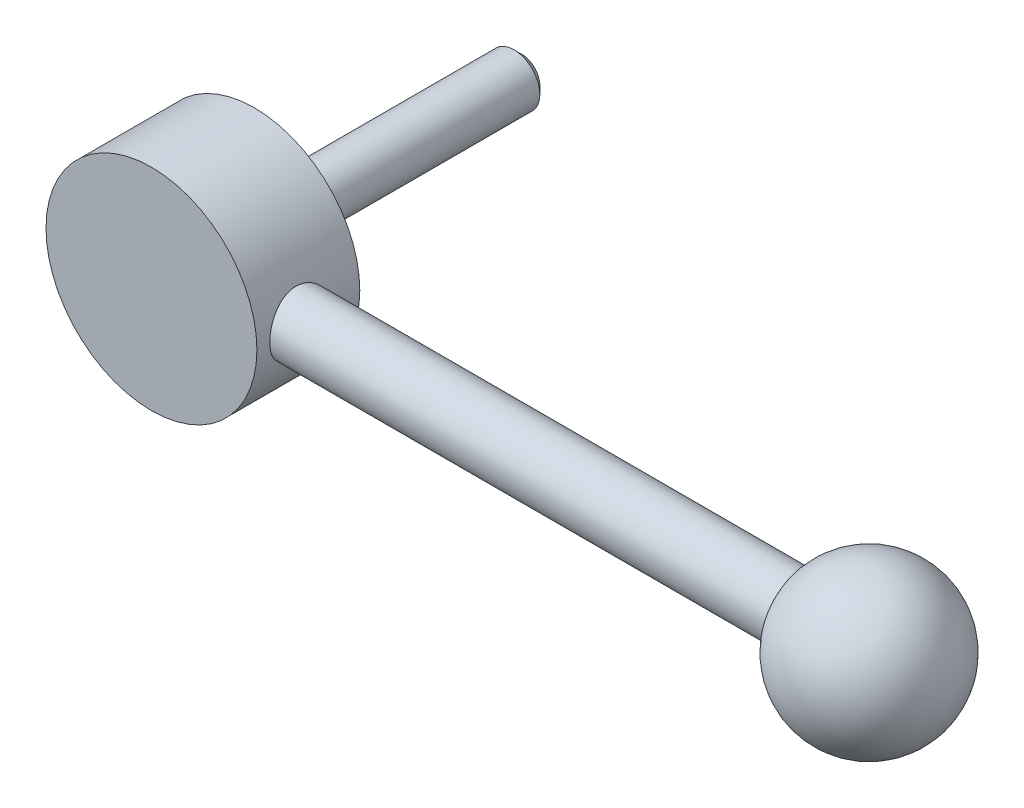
ISO-10303-21;
HEADER;
FILE_DESCRIPTION(('STEP AP214'),'2;1');
FILE_NAME('part.step','',(''),(''),'','','');
FILE_SCHEMA(('AUTOMOTIVE_DESIGN { 1 0 10303 214 1 1 1 1 }'));
ENDSEC;
DATA;
#1=APPLICATION_CONTEXT('core data for automotive mechanical design processes');
#2=APPLICATION_PROTOCOL_DEFINITION('international standard','automotive_design',2000,#1);
#3=PRODUCT_CONTEXT('',#1,'mechanical');
#4=PRODUCT('Part','Part','',(#3));
#5=PRODUCT_RELATED_PRODUCT_CATEGORY('part','',(#4));
#6=PRODUCT_DEFINITION_FORMATION('','',#4);
#7=PRODUCT_DEFINITION_CONTEXT('part definition',#1,'design');
#8=PRODUCT_DEFINITION('design','',#6,#7);
#9=PRODUCT_DEFINITION_SHAPE('','',#8);
#10=(LENGTH_UNIT() NAMED_UNIT(*) SI_UNIT(.MILLI.,.METRE.));
#11=(NAMED_UNIT(*) PLANE_ANGLE_UNIT() SI_UNIT($,.RADIAN.));
#12=(NAMED_UNIT(*) SI_UNIT($,.STERADIAN.) SOLID_ANGLE_UNIT());
#13=UNCERTAINTY_MEASURE_WITH_UNIT(LENGTH_MEASURE(1.E-05),#10,'distance_accuracy_value','');
#14=(GEOMETRIC_REPRESENTATION_CONTEXT(3) GLOBAL_UNCERTAINTY_ASSIGNED_CONTEXT((#13)) GLOBAL_UNIT_ASSIGNED_CONTEXT((#10,
#11,#12)) REPRESENTATION_CONTEXT('',''));
#15=CARTESIAN_POINT('',(0.,0.,0.));
#16=DIRECTION('',(0.,0.,1.));
#17=DIRECTION('',(1.,0.,0.));
#18=AXIS2_PLACEMENT_3D('',#15,#16,#17);
#19=CARTESIAN_POINT('',(0.,0.,40.));
#20=DIRECTION('',(0.,0.,1.));
#21=DIRECTION('',(1.,0.,0.));
#22=AXIS2_PLACEMENT_3D('',#19,#20,#21);
#23=CYLINDRICAL_SURFACE('',#22,9.5);
#24=CARTESIAN_POINT('',(0.,0.,2.));
#25=DIRECTION('',(0.,0.,1.));
#26=DIRECTION('',(1.,0.,0.));
#27=AXIS2_PLACEMENT_3D('',#24,#25,#26);
#28=CIRCLE('',#27,9.5);
#29=CARTESIAN_POINT('',(9.5,0.,2.));
#30=VERTEX_POINT('',#29);
#31=EDGE_CURVE('E37',#30,#30,#28,.T.);
#32=ORIENTED_EDGE('',*,*,#31,.F.);
#33=EDGE_LOOP('',(#32));
#34=FACE_BOUND('',#33,.T.);
#35=CARTESIAN_POINT('',(0.,0.,0.));
#36=DIRECTION('',(0.,0.,1.));
#37=DIRECTION('',(1.,0.,0.));
#38=AXIS2_PLACEMENT_3D('',#35,#36,#37);
#39=CIRCLE('',#38,9.5);
#40=CARTESIAN_POINT('',(9.5,0.,0.));
#41=VERTEX_POINT('',#40);
#42=EDGE_CURVE('E23',#41,#41,#39,.T.);
#43=ORIENTED_EDGE('',*,*,#42,.T.);
#44=EDGE_LOOP('',(#43));
#45=FACE_BOUND('',#44,.T.);
#46=ADVANCED_FACE('F12',(#34,#45),#23,.T.);
#47=CARTESIAN_POINT('',(5.,0.,0.));
#48=DIRECTION('',(0.,0.,1.));
#49=DIRECTION('',(1.,0.,0.));
#50=AXIS2_PLACEMENT_3D('',#47,#48,#49);
#51=PLANE('',#50);
#52=ORIENTED_EDGE('',*,*,#42,.F.);
#53=EDGE_LOOP('',(#52));
#54=FACE_BOUND('',#53,.T.);
#55=CARTESIAN_POINT('',(0.,0.,0.));
#56=DIRECTION('',(0.,0.,1.));
#57=DIRECTION('',(1.,0.,0.));
#58=AXIS2_PLACEMENT_3D('',#55,#56,#57);
#59=CIRCLE('',#58,5.);
#60=CARTESIAN_POINT('',(5.,0.,0.));
#61=VERTEX_POINT('',#60);
#62=EDGE_CURVE('E27',#61,#61,#59,.T.);
#63=ORIENTED_EDGE('',*,*,#62,.T.);
#64=EDGE_LOOP('',(#63));
#65=FACE_BOUND('',#64,.T.);
#66=ADVANCED_FACE('F63',(#54,#65),#51,.F.);
#67=CARTESIAN_POINT('',(0.,0.,40.));
#68=DIRECTION('',(0.,0.,1.));
#69=DIRECTION('',(1.,0.,0.));
#70=AXIS2_PLACEMENT_3D('',#67,#68,#69);
#71=CYLINDRICAL_SURFACE('',#70,5.);
#72=CARTESIAN_POINT('',(0.,0.,-48.5));
#73=DIRECTION('',(0.,0.,-1.));
#74=DIRECTION('',(-1.,0.,0.));
#75=AXIS2_PLACEMENT_3D('',#72,#73,#74);
#76=CIRCLE('',#75,5.);
#77=CARTESIAN_POINT('',(-5.,0.,-48.5));
#78=VERTEX_POINT('',#77);
#79=EDGE_CURVE('E19',#78,#78,#76,.F.);
#80=ORIENTED_EDGE('',*,*,#79,.T.);
#81=EDGE_LOOP('',(#80));
#82=FACE_BOUND('',#81,.T.);
#83=ORIENTED_EDGE('',*,*,#62,.F.);
#84=EDGE_LOOP('',(#83));
#85=FACE_BOUND('',#84,.T.);
#86=ADVANCED_FACE('F69',(#82,#85),#71,.T.);
#87=CARTESIAN_POINT('',(5.,0.,-50.));
#88=DIRECTION('',(0.,0.,-1.));
#89=DIRECTION('',(-1.,0.,0.));
#90=AXIS2_PLACEMENT_3D('',#87,#88,#89);
#91=PLANE('',#90);
#92=CARTESIAN_POINT('',(0.,0.,-50.));
#93=DIRECTION('',(0.,0.,-1.));
#94=DIRECTION('',(-1.,0.,0.));
#95=AXIS2_PLACEMENT_3D('',#92,#93,#94);
#96=CIRCLE('',#95,3.5);
#97=CARTESIAN_POINT('',(-3.5,0.,-50.));
#98=VERTEX_POINT('',#97);
#99=EDGE_CURVE('E8',#98,#98,#96,.T.);
#100=ORIENTED_EDGE('',*,*,#99,.T.);
#101=EDGE_LOOP('',(#100));
#102=FACE_BOUND('',#101,.T.);
#103=ADVANCED_FACE('F77',(#102),#91,.T.);
#104=CARTESIAN_POINT('',(20.5,0.,22.));
#105=DIRECTION('',(0.,0.,-1.));
#106=DIRECTION('',(-1.,0.,0.));
#107=AXIS2_PLACEMENT_3D('',#104,#105,#106);
#108=PLANE('',#107);
#109=CARTESIAN_POINT('',(0.,0.,22.));
#110=DIRECTION('',(0.,0.,1.));
#111=DIRECTION('',(1.,0.,0.));
#112=AXIS2_PLACEMENT_3D('',#109,#110,#111);
#113=CIRCLE('',#112,20.5);
#114=CARTESIAN_POINT('',(20.5,0.,22.));
#115=VERTEX_POINT('',#114);
#116=EDGE_CURVE('E86',#115,#115,#113,.T.);
#117=ORIENTED_EDGE('',*,*,#116,.T.);
#118=EDGE_LOOP('',(#117));
#119=FACE_BOUND('',#118,.T.);
#120=ADVANCED_FACE('F58',(#119),#108,.F.);
#121=CARTESIAN_POINT('',(0.,0.,40.));
#122=DIRECTION('',(0.,0.,1.));
#123=DIRECTION('',(1.,0.,0.));
#124=AXIS2_PLACEMENT_3D('',#121,#122,#123);
#125=CYLINDRICAL_SURFACE('',#124,20.5);
#126=CARTESIAN_POINT('',(20.5,0.,7.5));
#127=CARTESIAN_POINT('',(20.4999997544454,-0.164768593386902,7.50000038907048));
#128=CARTESIAN_POINT('',(20.4980087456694,-0.329544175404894,7.50679278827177));
#129=CARTESIAN_POINT('',(20.4900990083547,-0.65788822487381,7.5339021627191));
#130=CARTESIAN_POINT('',(20.4841800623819,-0.821456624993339,7.55421988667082));
#131=CARTESIAN_POINT('',(20.4685766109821,-1.1462122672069,7.60820100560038));
#132=CARTESIAN_POINT('',(20.4588916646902,-1.30739922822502,7.64186596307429));
#133=CARTESIAN_POINT('',(20.4360164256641,-1.62628314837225,7.72226244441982));
#134=CARTESIAN_POINT('',(20.4228249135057,-1.7839788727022,7.76899851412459));
#135=CARTESIAN_POINT('',(20.3933182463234,-2.09448185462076,7.87505403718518));
#136=CARTESIAN_POINT('',(20.3770082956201,-2.24729676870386,7.93435254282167));
#137=CARTESIAN_POINT('',(20.3416823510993,-2.54730770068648,8.06511256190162));
#138=CARTESIAN_POINT('',(20.3226662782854,-2.69450355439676,8.13657443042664));
#139=CARTESIAN_POINT('',(20.2824208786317,-2.98237032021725,8.2911456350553));
#140=CARTESIAN_POINT('',(20.2611910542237,-3.123039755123,8.37425759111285));
#141=CARTESIAN_POINT('',(20.2170775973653,-3.39691169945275,8.55150630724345));
#142=CARTESIAN_POINT('',(20.1941944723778,-3.53011647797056,8.6456396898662));
#143=CARTESIAN_POINT('',(20.146767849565,-3.79154794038,8.84682399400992));
#144=CARTESIAN_POINT('',(20.1221971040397,-3.91956600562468,8.95413966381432));
#145=CARTESIAN_POINT('',(20.0725990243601,-4.1661228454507,9.17897611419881));
#146=CARTESIAN_POINT('',(20.0475718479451,-4.2846648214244,9.29649342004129));
#147=CARTESIAN_POINT('',(19.9977175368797,-4.5116297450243,9.54108035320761));
#148=CARTESIAN_POINT('',(19.9728905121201,-4.62004743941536,9.66815487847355));
#149=CARTESIAN_POINT('',(19.9241410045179,-4.82595045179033,9.93095842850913));
#150=CARTESIAN_POINT('',(19.9002181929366,-4.92343976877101,10.0666842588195));
#151=CARTESIAN_POINT('',(19.8534354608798,-5.10885934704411,10.3490171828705));
#152=CARTESIAN_POINT('',(19.8306098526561,-5.19653638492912,10.4957964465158));
#153=CARTESIAN_POINT('',(19.7872868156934,-5.35913808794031,10.7965125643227));
#154=CARTESIAN_POINT('',(19.766788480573,-5.43406772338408,10.9504465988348));
#155=CARTESIAN_POINT('',(19.7287391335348,-5.57062666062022,11.2645036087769));
#156=CARTESIAN_POINT('',(19.7111887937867,-5.63225293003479,11.4246279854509));
#157=CARTESIAN_POINT('',(19.6796082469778,-5.74162541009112,11.7498143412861));
#158=CARTESIAN_POINT('',(19.6655765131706,-5.78937764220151,11.9148741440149));
#159=CARTESIAN_POINT('',(19.6418018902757,-5.86952471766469,12.2443484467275));
#160=CARTESIAN_POINT('',(19.6319555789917,-5.90229162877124,12.4086649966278));
#161=CARTESIAN_POINT('',(19.6163432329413,-5.95397424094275,12.7395899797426));
#162=CARTESIAN_POINT('',(19.6105755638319,-5.97289549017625,12.9061974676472));
#163=CARTESIAN_POINT('',(19.603301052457,-5.99672775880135,13.2405034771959));
#164=CARTESIAN_POINT('',(19.6017941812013,-6.00163887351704,13.4082019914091));
#165=CARTESIAN_POINT('',(19.6030905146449,-5.99740342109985,13.7434027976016));
#166=CARTESIAN_POINT('',(19.6058936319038,-5.98825713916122,13.9109050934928));
#167=CARTESIAN_POINT('',(19.6155486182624,-5.95655212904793,14.238688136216));
#168=CARTESIAN_POINT('',(19.6222578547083,-5.9344657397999,14.3990190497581));
#169=CARTESIAN_POINT('',(19.6394095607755,-5.87745500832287,14.7172343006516));
#170=CARTESIAN_POINT('',(19.649853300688,-5.84252629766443,14.8751177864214));
#171=CARTESIAN_POINT('',(19.6741615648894,-5.7601395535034,15.187257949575));
#172=CARTESIAN_POINT('',(19.688025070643,-5.71268525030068,15.3415156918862));
#173=CARTESIAN_POINT('',(19.7187796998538,-5.60560692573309,15.6454959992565));
#174=CARTESIAN_POINT('',(19.7356719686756,-5.5459782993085,15.7952168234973));
#175=CARTESIAN_POINT('',(19.7722410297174,-5.41416819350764,16.0910079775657));
#176=CARTESIAN_POINT('',(19.7919506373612,-5.34183608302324,16.2370072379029));
#177=CARTESIAN_POINT('',(19.8334359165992,-5.18568691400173,16.5224423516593));
#178=CARTESIAN_POINT('',(19.8552123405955,-5.10186566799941,16.6618757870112));
#179=CARTESIAN_POINT('',(19.9227548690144,-4.8340177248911,17.0689782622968));
#180=CARTESIAN_POINT('',(19.9707648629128,-4.63350124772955,17.3256854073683));
#181=CARTESIAN_POINT('',(20.0696162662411,-4.18511260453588,17.8126329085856));
#182=CARTESIAN_POINT('',(20.1204944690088,-3.93567819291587,18.0414205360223));
#183=CARTESIAN_POINT('',(20.2176813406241,-3.40132203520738,18.4542852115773));
#184=CARTESIAN_POINT('',(20.2639897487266,-3.11639826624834,18.63835970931));
#185=CARTESIAN_POINT('',(20.3472018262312,-2.51664006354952,18.9573414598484));
#186=CARTESIAN_POINT('',(20.3840462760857,-2.2016334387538,19.0919412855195));
#187=CARTESIAN_POINT('',(20.4437541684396,-1.55212614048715,19.3058343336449));
#188=CARTESIAN_POINT('',(20.4666213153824,-1.21763065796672,19.3851422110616));
#189=CARTESIAN_POINT('',(20.4952175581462,-0.550953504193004,19.4838192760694));
#190=CARTESIAN_POINT('',(20.5015074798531,-0.219085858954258,19.5051506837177));
#191=CARTESIAN_POINT('',(20.4978783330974,0.44350281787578,19.4927506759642));
#192=CARTESIAN_POINT('',(20.4879613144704,0.774223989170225,19.4590262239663));
#193=CARTESIAN_POINT('',(20.4533992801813,1.41781519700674,19.3390673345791));
#194=CARTESIAN_POINT('',(20.4290727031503,1.73091547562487,19.253967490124));
#195=CARTESIAN_POINT('',(20.3684901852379,2.33834273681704,19.0350155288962));
#196=CARTESIAN_POINT('',(20.3322328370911,2.63266749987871,18.901157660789));
#197=CARTESIAN_POINT('',(20.2505580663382,3.201467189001,18.585163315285));
#198=CARTESIAN_POINT('',(20.2049537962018,3.47535043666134,18.4020133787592));
#199=CARTESIAN_POINT('',(20.1098009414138,3.98926947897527,17.9937010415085));
#200=CARTESIAN_POINT('',(20.0602514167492,4.22929716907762,17.7685286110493));
#201=CARTESIAN_POINT('',(19.9860369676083,4.56311282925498,17.3996018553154));
#202=CARTESIAN_POINT('',(19.9608943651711,4.67160496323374,17.2689475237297));
#203=CARTESIAN_POINT('',(19.9116554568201,4.87720494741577,16.9988051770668));
#204=CARTESIAN_POINT('',(19.8875587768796,4.97431688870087,16.8593203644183));
#205=CARTESIAN_POINT('',(19.8411019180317,5.15650338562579,16.5723575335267));
#206=CARTESIAN_POINT('',(19.8187424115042,5.24157329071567,16.4248764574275));
#207=CARTESIAN_POINT('',(19.7764458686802,5.39896546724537,16.1230001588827));
#208=CARTESIAN_POINT('',(19.7565078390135,5.47129297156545,15.9686078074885));
#209=CARTESIAN_POINT('',(19.7197444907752,5.60234699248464,15.6546484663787));
#210=CARTESIAN_POINT('',(19.7029051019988,5.6611353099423,15.49510893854));
#211=CARTESIAN_POINT('',(19.6727610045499,5.76501533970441,15.1713718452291));
#212=CARTESIAN_POINT('',(19.6594548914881,5.81011249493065,15.0071761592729));
#213=CARTESIAN_POINT('',(19.6367999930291,5.88622676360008,14.675294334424));
#214=CARTESIAN_POINT('',(19.6274509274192,5.91724487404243,14.5076084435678));
#215=CARTESIAN_POINT('',(19.6130187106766,5.96490739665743,14.1700260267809));
#216=CARTESIAN_POINT('',(19.6079354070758,5.98155232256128,14.0001295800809));
#217=CARTESIAN_POINT('',(19.6023186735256,5.9999323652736,13.6662567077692));
#218=CARTESIAN_POINT('',(19.6016119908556,6.00223524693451,13.5023141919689));
#219=CARTESIAN_POINT('',(19.6043094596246,5.99341910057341,13.1747666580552));
#220=CARTESIAN_POINT('',(19.6077150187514,5.98229547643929,13.0111617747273));
#221=CARTESIAN_POINT('',(19.6185313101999,5.94672790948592,12.6856110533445));
#222=CARTESIAN_POINT('',(19.6259403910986,5.92228945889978,12.5236645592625));
#223=CARTESIAN_POINT('',(19.6445384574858,5.86030325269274,12.2024601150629));
#224=CARTESIAN_POINT('',(19.6557288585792,5.82275058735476,12.0432031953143));
#225=CARTESIAN_POINT('',(19.6814005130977,5.73537439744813,11.7303823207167));
#226=CARTESIAN_POINT('',(19.6958418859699,5.68569901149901,11.5767736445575));
#227=CARTESIAN_POINT('',(19.7276768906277,5.57423736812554,11.2742707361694));
#228=CARTESIAN_POINT('',(19.7450715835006,5.51244675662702,11.125378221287));
#229=CARTESIAN_POINT('',(19.782319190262,5.37724463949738,10.8333301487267));
#230=CARTESIAN_POINT('',(19.802171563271,5.30383568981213,10.6901733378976));
#231=CARTESIAN_POINT('',(19.8438063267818,5.14587421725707,10.4103722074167));
#232=CARTESIAN_POINT('',(19.8655894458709,5.061317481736,10.2737303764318));
#233=CARTESIAN_POINT('',(19.9112797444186,4.87853600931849,10.0032239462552));
#234=CARTESIAN_POINT('',(19.9352342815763,4.77994030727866,9.86961789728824));
#235=CARTESIAN_POINT('',(19.9839347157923,4.57206196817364,9.61107007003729));
#236=CARTESIAN_POINT('',(20.0086809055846,4.46277534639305,9.48613155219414));
#237=CARTESIAN_POINT('',(20.0582834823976,4.23425660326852,9.24575891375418));
#238=CARTESIAN_POINT('',(20.0831398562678,4.11502564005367,9.13032368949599));
#239=CARTESIAN_POINT('',(20.1323098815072,3.86730499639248,8.90963180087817));
#240=CARTESIAN_POINT('',(20.1566233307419,3.7388119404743,8.80437888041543));
#241=CARTESIAN_POINT('',(20.2046974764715,3.46977987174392,8.6020699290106));
#242=CARTESIAN_POINT('',(20.2284250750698,3.32900807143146,8.50531528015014));
#243=CARTESIAN_POINT('',(20.2739466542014,3.03949915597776,8.32403500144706));
#244=CARTESIAN_POINT('',(20.2957406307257,2.8907620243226,8.23950939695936));
#245=CARTESIAN_POINT('',(20.3367679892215,2.58639447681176,8.0833769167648));
#246=CARTESIAN_POINT('',(20.356002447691,2.43076699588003,8.01176460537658));
#247=CARTESIAN_POINT('',(20.3913677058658,2.11366097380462,7.88201306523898));
#248=CARTESIAN_POINT('',(20.4074988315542,1.95218304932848,7.82387242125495));
#249=CARTESIAN_POINT('',(20.4344672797,1.64423058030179,7.72771145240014));
#250=CARTESIAN_POINT('',(20.4457076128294,1.49828162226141,7.68811373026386));
#251=CARTESIAN_POINT('',(20.4651675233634,1.2036242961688,7.62002138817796));
#252=CARTESIAN_POINT('',(20.4733873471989,1.0549161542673,7.59152586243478));
#253=CARTESIAN_POINT('',(20.4866168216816,0.755624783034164,7.54584620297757));
#254=CARTESIAN_POINT('',(20.491626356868,0.605041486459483,7.52866247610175));
#255=CARTESIAN_POINT('',(20.49831762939,0.302973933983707,7.50574067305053));
#256=CARTESIAN_POINT('',(20.5000002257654,0.151489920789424,7.49999964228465));
#257=CARTESIAN_POINT('',(20.5,0.,7.5));
#258=B_SPLINE_CURVE_WITH_KNOTS('',3,(#126,#127,#128,#129,#130,#131,#132,#133,#134,#135,#136,
#137,#138,#139,#140,#141,#142,#143,#144,#145,#146,#147,#148,#149,#150,#151,#152,#153,#154,#155,
#156,#157,#158,#159,#160,#161,#162,#163,#164,#165,#166,#167,#168,#169,#170,#171,#172,#173,#174,
#175,#176,#177,#178,#179,#180,#181,#182,#183,#184,#185,#186,#187,#188,#189,#190,#191,#192,#193,
#194,#195,#196,#197,#198,#199,#200,#201,#202,#203,#204,#205,#206,#207,#208,#209,#210,#211,#212,
#213,#214,#215,#216,#217,#218,#219,#220,#221,#222,#223,#224,#225,#226,#227,#228,#229,#230,#231,
#232,#233,#234,#235,#236,#237,#238,#239,#240,#241,#242,#243,#244,#245,#246,#247,#248,#249,#250,
#251,#252,#253,#254,#255,#256,#257),.UNSPECIFIED.,.T.,.F.,(4,2,2,2,2,2,2,2,2,2,2,2,2,2,2,2,2,2,
2,2,2,2,2,2,2,2,2,2,2,2,2,2,2,2,2,2,2,2,2,2,2,2,2,2,2,2,2,2,2,2,2,2,2,2,2,2,2,2,2,2,2,2,2,2,2,
4),(0.,0.494166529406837,0.988360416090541,1.48261217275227,1.97703603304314,2.47064184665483,
2.96426207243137,3.45799348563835,3.95157399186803,4.45753270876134,4.96331976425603,
5.46936781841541,5.97523008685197,6.49206535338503,7.00869863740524,7.52544955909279,
8.04197586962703,8.54486934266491,9.04756118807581,9.55024961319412,10.0529278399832,
10.5383093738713,11.0238561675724,11.5092585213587,11.9948448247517,12.4866344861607,
12.9786038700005,13.9617709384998,14.9839152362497,16.006117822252,17.0345689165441,
18.062747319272,19.0556662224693,20.0484595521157,21.0200911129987,21.9918373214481,
22.9853318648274,23.97906383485,24.4935931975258,25.0079370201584,25.5224789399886,
26.0368090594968,26.5487427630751,27.0604726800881,27.5721663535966,28.0838417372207,
28.5751252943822,29.066577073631,29.5578262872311,30.0492596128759,30.5349645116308,
31.0208442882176,31.5066173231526,31.9925744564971,32.4953010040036,32.9982156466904,
33.5010718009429,34.0041121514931,34.5208552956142,35.0375995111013,35.5541256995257,
36.0705976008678,36.525077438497,36.9795201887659,37.4339792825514,37.8883210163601),.UNSPECIFIED.);
#259=CARTESIAN_POINT('',(20.5,0.,7.5));
#260=VERTEX_POINT('',#259);
#261=EDGE_CURVE('E30',#260,#260,#258,.T.);
#262=ORIENTED_EDGE('',*,*,#261,.T.);
#263=EDGE_LOOP('',(#262));
#264=FACE_BOUND('',#263,.T.);
#265=ORIENTED_EDGE('',*,*,#116,.F.);
#266=EDGE_LOOP('',(#265));
#267=FACE_BOUND('',#266,.T.);
#268=CARTESIAN_POINT('',(0.,0.,2.));
#269=DIRECTION('',(0.,0.,1.));
#270=DIRECTION('',(1.,0.,0.));
#271=AXIS2_PLACEMENT_3D('',#268,#269,#270);
#272=CIRCLE('',#271,20.5);
#273=CARTESIAN_POINT('',(20.5,0.,2.));
#274=VERTEX_POINT('',#273);
#275=EDGE_CURVE('E88',#274,#274,#272,.T.);
#276=ORIENTED_EDGE('',*,*,#275,.T.);
#277=EDGE_LOOP('',(#276));
#278=FACE_BOUND('',#277,.T.);
#279=ADVANCED_FACE('F40',(#264,#267,#278),#125,.T.);
#280=CARTESIAN_POINT('',(9.5,0.,2.));
#281=DIRECTION('',(0.,0.,1.));
#282=DIRECTION('',(1.,0.,0.));
#283=AXIS2_PLACEMENT_3D('',#280,#281,#282);
#284=PLANE('',#283);
#285=ORIENTED_EDGE('',*,*,#275,.F.);
#286=EDGE_LOOP('',(#285));
#287=FACE_BOUND('',#286,.T.);
#288=ORIENTED_EDGE('',*,*,#31,.T.);
#289=EDGE_LOOP('',(#288));
#290=FACE_BOUND('',#289,.T.);
#291=ADVANCED_FACE('F49',(#287,#290),#284,.F.);
#292=CARTESIAN_POINT('',(-30.,0.,13.5));
#293=DIRECTION('',(-1.,0.,0.));
#294=DIRECTION('',(0.,0.,1.));
#295=AXIS2_PLACEMENT_3D('',#292,#293,#294);
#296=CYLINDRICAL_SURFACE('',#295,6.);
#297=CARTESIAN_POINT('',(117.252272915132,0.,13.5));
#298=DIRECTION('',(-1.,0.,0.));
#299=DIRECTION('',(0.,0.,1.));
#300=AXIS2_PLACEMENT_3D('',#297,#298,#299);
#301=CIRCLE('',#300,6.);
#302=CARTESIAN_POINT('',(117.252272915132,0.,19.5));
#303=VERTEX_POINT('',#302);
#304=EDGE_CURVE('E38',#303,#303,#301,.T.);
#305=ORIENTED_EDGE('',*,*,#304,.T.);
#306=EDGE_LOOP('',(#305));
#307=FACE_BOUND('',#306,.T.);
#308=ORIENTED_EDGE('',*,*,#261,.F.);
#309=EDGE_LOOP('',(#308));
#310=FACE_BOUND('',#309,.T.);
#311=ADVANCED_FACE('F44',(#307,#310),#296,.T.);
#312=CARTESIAN_POINT('',(131.,0.,13.5));
#313=DIRECTION('',(0.,0.,1.));
#314=DIRECTION('',(1.,0.,0.));
#315=AXIS2_PLACEMENT_3D('',#312,#313,#314);
#316=SPHERICAL_SURFACE('',#315,15.);
#317=CARTESIAN_POINT('',(131.,0.,13.5));
#318=DIRECTION('',(-1.,0.,0.));
#319=DIRECTION('',(0.,0.,1.));
#320=AXIS2_PLACEMENT_3D('',#317,#318,#319);
#321=SPHERICAL_SURFACE('',#320,15.);
#322=ORIENTED_EDGE('',*,*,#304,.F.);
#323=EDGE_LOOP('',(#322));
#324=FACE_BOUND('',#323,.T.);
#325=ADVANCED_FACE('F48',(#324),#321,.T.);
#326=CARTESIAN_POINT('',(0.,0.,-48.5));
#327=DIRECTION('',(0.,0.,1.));
#328=DIRECTION('',(1.,0.,0.));
#329=AXIS2_PLACEMENT_3D('',#326,#327,#328);
#330=CONICAL_SURFACE('',#329,5.,0.785398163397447);
#331=ORIENTED_EDGE('',*,*,#99,.F.);
#332=EDGE_LOOP('',(#331));
#333=FACE_BOUND('',#332,.T.);
#334=ORIENTED_EDGE('',*,*,#79,.F.);
#335=EDGE_LOOP('',(#334));
#336=FACE_BOUND('',#335,.T.);
#337=ADVANCED_FACE('F14',(#333,#336),#330,.T.);
#338=CLOSED_SHELL('',(#46,#66,#86,#103,#120,#279,#291,#311,#325,#337));
#339=MANIFOLD_SOLID_BREP('B1',#338);
#340=ADVANCED_BREP_SHAPE_REPRESENTATION('',(#18,#339),#14);
#341=SHAPE_DEFINITION_REPRESENTATION(#9,#340);
ENDSEC;
END-ISO-10303-21;
